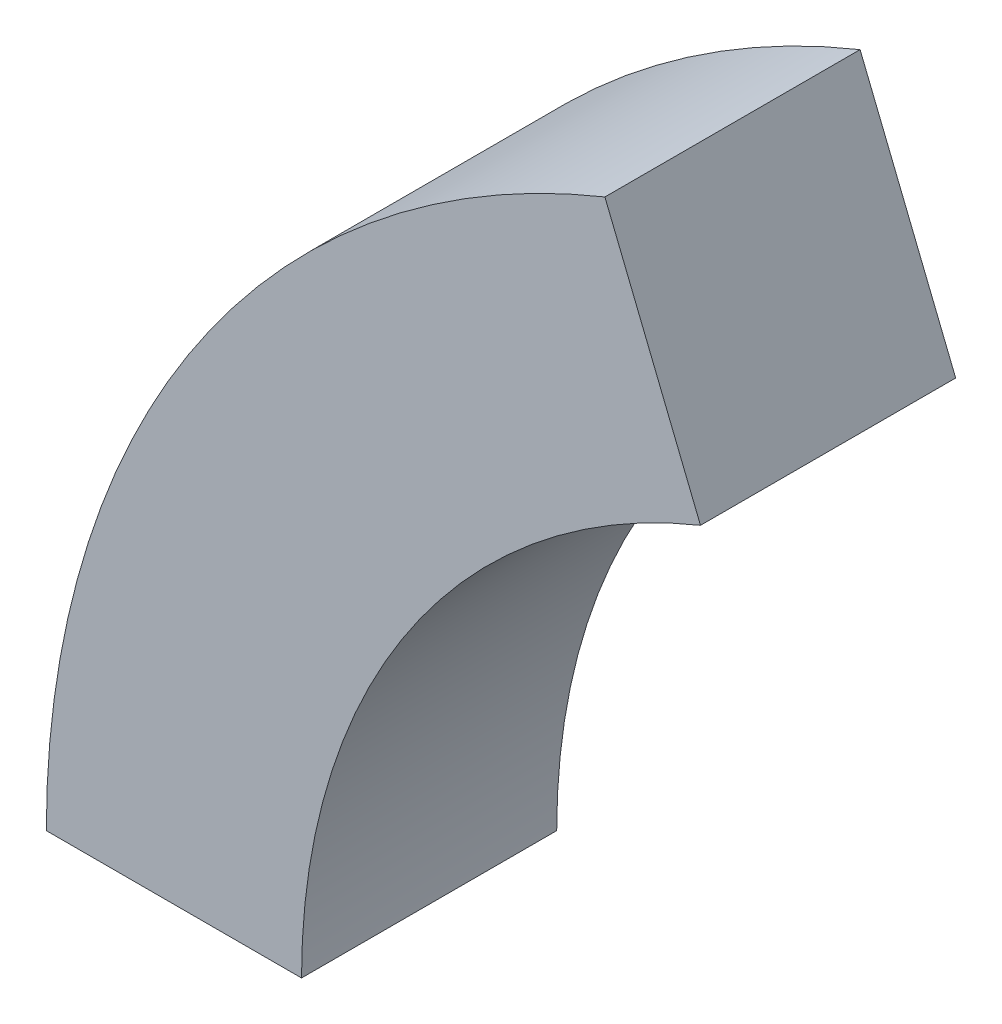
from build123d import *

# Parameters (mm, degrees)
ESQUISSE1_W = 14
ESQUISSE1_H = 14


with BuildPart() as part:
    # Balayage1: sweep along a path in Esquisse2
    with BuildLine(Plane.XY) as balayage1_path:
        ThreePointArc((0, 0), (5.983684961, 19.571751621), (21.88876923, 32.45143491))
    # Esquisse1 → Balayage1 (sweep)
    with BuildSketch(Plane(origin=(0, 0, 0), x_dir=(1, 0, 0), z_dir=(0, 1, 0))):
        with Locations((-7, 7)):
            Rectangle(ESQUISSE1_W, ESQUISSE1_H)
    sweep(path=balayage1_path.line)


solid = part.part
